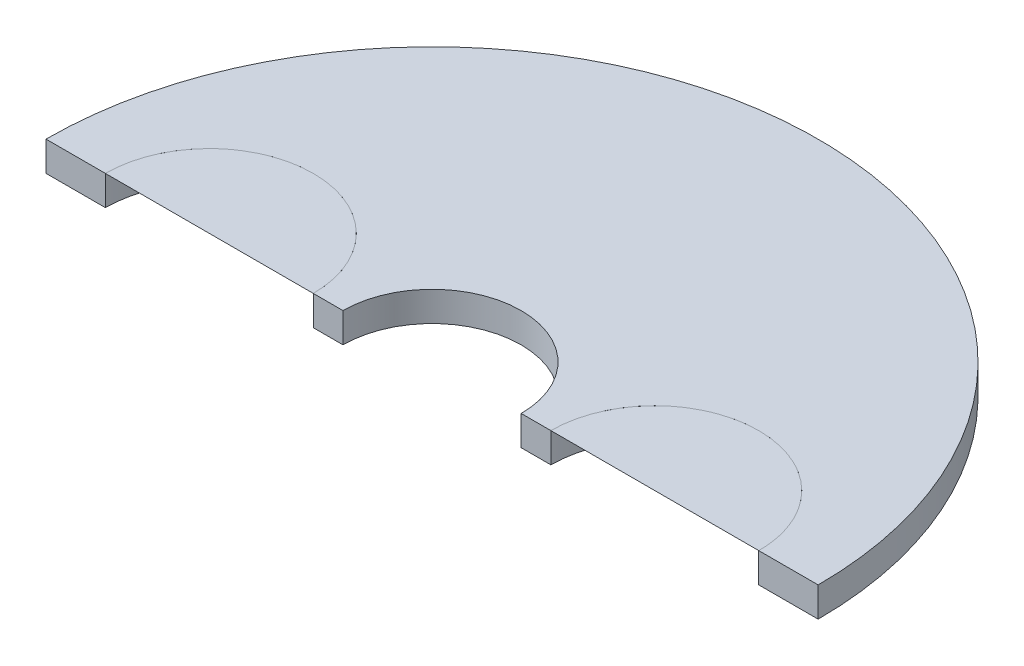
ISO-10303-21;
HEADER;
FILE_DESCRIPTION(('STEP AP214'),'2;1');
FILE_NAME('part.step','',(''),(''),'','','');
FILE_SCHEMA(('AUTOMOTIVE_DESIGN { 1 0 10303 214 1 1 1 1 }'));
ENDSEC;
DATA;
#1=APPLICATION_CONTEXT('core data for automotive mechanical design processes');
#2=APPLICATION_PROTOCOL_DEFINITION('international standard','automotive_design',2000,#1);
#3=PRODUCT_CONTEXT('',#1,'mechanical');
#4=PRODUCT('Part','Part','',(#3));
#5=PRODUCT_RELATED_PRODUCT_CATEGORY('part','',(#4));
#6=PRODUCT_DEFINITION_FORMATION('','',#4);
#7=PRODUCT_DEFINITION_CONTEXT('part definition',#1,'design');
#8=PRODUCT_DEFINITION('design','',#6,#7);
#9=PRODUCT_DEFINITION_SHAPE('','',#8);
#10=(LENGTH_UNIT() NAMED_UNIT(*) SI_UNIT(.MILLI.,.METRE.));
#11=(NAMED_UNIT(*) PLANE_ANGLE_UNIT() SI_UNIT($,.RADIAN.));
#12=(NAMED_UNIT(*) SI_UNIT($,.STERADIAN.) SOLID_ANGLE_UNIT());
#13=UNCERTAINTY_MEASURE_WITH_UNIT(LENGTH_MEASURE(1.E-05),#10,'distance_accuracy_value','');
#14=(GEOMETRIC_REPRESENTATION_CONTEXT(3) GLOBAL_UNCERTAINTY_ASSIGNED_CONTEXT((#13)) GLOBAL_UNIT_ASSIGNED_CONTEXT((#10,
#11,#12)) REPRESENTATION_CONTEXT('',''));
#15=CARTESIAN_POINT('',(0.,0.,0.));
#16=DIRECTION('',(0.,0.,1.));
#17=DIRECTION('',(1.,0.,0.));
#18=AXIS2_PLACEMENT_3D('',#15,#16,#17);
#19=CARTESIAN_POINT('',(4.,1.,0.));
#20=DIRECTION('',(0.,1.,0.));
#21=DIRECTION('',(1.,0.,0.));
#22=AXIS2_PLACEMENT_3D('',#19,#20,#21);
#23=PLANE('',#22);
#24=DIRECTION('',(1.,0.,0.));
#25=VECTOR('',#24,1.);
#26=CARTESIAN_POINT('',(7.5,1.,0.));
#27=LINE('',#26,#25);
#28=CARTESIAN_POINT('',(4.,1.,0.));
#29=VERTEX_POINT('',#28);
#30=CARTESIAN_POINT('',(11.,1.,0.));
#31=VERTEX_POINT('',#30);
#32=EDGE_CURVE('E12',#29,#31,#27,.T.);
#33=ORIENTED_EDGE('',*,*,#32,.T.);
#34=CARTESIAN_POINT('',(4.,1.,0.));
#35=CARTESIAN_POINT('',(4.,1.,-0.291666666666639));
#36=CARTESIAN_POINT('',(4.03546666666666,1.,-0.621599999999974));
#37=CARTESIAN_POINT('',(4.24453333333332,1.,-1.33839999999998));
#38=CARTESIAN_POINT('',(4.41999999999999,1.,-1.72666666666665));
#39=CARTESIAN_POINT('',(4.83999999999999,1.,-2.28666666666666));
#40=CARTESIAN_POINT('',(5.00597360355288,1.,-2.46884969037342));
#41=CARTESIAN_POINT('',(5.39128667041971,1.,-2.80512291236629));
#42=CARTESIAN_POINT('',(5.61072664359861,1.,-2.95905420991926));
#43=CARTESIAN_POINT('',(6.09515570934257,1.,-3.21741637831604));
#44=CARTESIAN_POINT('',(6.36011834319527,1.,-3.32161735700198));
#45=CARTESIAN_POINT('',(6.91680473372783,1.,-3.46299802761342));
#46=CARTESIAN_POINT('',(7.20833333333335,1.,-3.5));
#47=CARTESIAN_POINT('',(7.7916666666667,1.,-3.5));
#48=CARTESIAN_POINT('',(8.08319526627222,1.,-3.46299802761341));
#49=CARTESIAN_POINT('',(8.63988165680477,1.,-3.32161735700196));
#50=CARTESIAN_POINT('',(8.90484429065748,1.,-3.21741637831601));
#51=CARTESIAN_POINT('',(9.38927335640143,1.,-2.95905420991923));
#52=CARTESIAN_POINT('',(9.60871332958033,1.,-2.80512291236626));
#53=CARTESIAN_POINT('',(9.99402639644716,1.,-2.46884969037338));
#54=CARTESIAN_POINT('',(10.16,1.,-2.28666666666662));
#55=CARTESIAN_POINT('',(10.58,1.,-1.72666666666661));
#56=CARTESIAN_POINT('',(10.7554666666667,1.,-1.33839999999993));
#57=CARTESIAN_POINT('',(10.9645333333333,1.,-0.621599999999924));
#58=CARTESIAN_POINT('',(11.,1.,-0.291666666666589));
#59=CARTESIAN_POINT('',(11.,1.,0.));
#60=B_SPLINE_CURVE_WITH_KNOTS('',3,(#34,#35,#36,#37,#38,#39,#40,#41,#42,#43,#44,#45,#46,#47,#48,
#49,#50,#51,#52,#53,#54,#55,#56,#57,#58,#59),.UNSPECIFIED.,.F.,.F.,(4,2,2,2,2,2,2,2,2,2,2,2,4),
(0.,0.125,0.25,0.3125,0.375,0.4375,0.5,0.5625,0.625,0.6875,0.75,0.875,1.),.UNSPECIFIED.);
#61=EDGE_CURVE('E49',#31,#29,#60,.F.);
#62=ORIENTED_EDGE('',*,*,#61,.T.);
#63=EDGE_LOOP('',(#33,#62));
#64=FACE_BOUND('',#63,.T.);
#65=ADVANCED_FACE('F44',(#64),#23,.T.);
#66=OPEN_SHELL('',(#65));
#67=SHELL_BASED_SURFACE_MODEL('B2',(#66));
#68=CARTESIAN_POINT('',(-11.,1.,0.));
#69=DIRECTION('',(0.,1.,0.));
#70=DIRECTION('',(1.,0.,0.));
#71=AXIS2_PLACEMENT_3D('',#68,#69,#70);
#72=PLANE('',#71);
#73=DIRECTION('',(1.,0.,0.));
#74=VECTOR('',#73,1.);
#75=CARTESIAN_POINT('',(-7.5,1.,0.));
#76=LINE('',#75,#74);
#77=CARTESIAN_POINT('',(-11.,1.,0.));
#78=VERTEX_POINT('',#77);
#79=CARTESIAN_POINT('',(-4.,1.,0.));
#80=VERTEX_POINT('',#79);
#81=EDGE_CURVE('E42',#78,#80,#76,.T.);
#82=ORIENTED_EDGE('',*,*,#81,.T.);
#83=CARTESIAN_POINT('',(-11.,1.,0.));
#84=CARTESIAN_POINT('',(-11.,1.,-0.291666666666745));
#85=CARTESIAN_POINT('',(-10.9645333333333,1.,-0.621600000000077));
#86=CARTESIAN_POINT('',(-10.7554666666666,1.,-1.33840000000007));
#87=CARTESIAN_POINT('',(-10.58,1.,-1.72666666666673));
#88=CARTESIAN_POINT('',(-10.16,1.,-2.28666666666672));
#89=CARTESIAN_POINT('',(-9.99402639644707,1.,-2.46884969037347));
#90=CARTESIAN_POINT('',(-9.60871332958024,1.,-2.80512291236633));
#91=CARTESIAN_POINT('',(-9.38927335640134,1.,-2.95905420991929));
#92=CARTESIAN_POINT('',(-8.9048442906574,1.,-3.21741637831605));
#93=CARTESIAN_POINT('',(-8.63988165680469,1.,-3.32161735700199));
#94=CARTESIAN_POINT('',(-8.08319526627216,1.,-3.46299802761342));
#95=CARTESIAN_POINT('',(-7.79166666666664,1.,-3.5));
#96=CARTESIAN_POINT('',(-7.20833333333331,1.,-3.5));
#97=CARTESIAN_POINT('',(-6.9168047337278,1.,-3.46299802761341));
#98=CARTESIAN_POINT('',(-6.36011834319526,1.,-3.32161735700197));
#99=CARTESIAN_POINT('',(-6.09515570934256,1.,-3.21741637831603));
#100=CARTESIAN_POINT('',(-5.61072664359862,1.,-2.95905420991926));
#101=CARTESIAN_POINT('',(-5.39128667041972,1.,-2.8051229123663));
#102=CARTESIAN_POINT('',(-5.00597360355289,1.,-2.46884969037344));
#103=CARTESIAN_POINT('',(-4.84000000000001,1.,-2.28666666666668));
#104=CARTESIAN_POINT('',(-4.42000000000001,1.,-1.72666666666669));
#105=CARTESIAN_POINT('',(-4.24453333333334,1.,-1.33840000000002));
#106=CARTESIAN_POINT('',(-4.03546666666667,1.,-0.621600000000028));
#107=CARTESIAN_POINT('',(-4.,1.,-0.291666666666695));
#108=CARTESIAN_POINT('',(-4.,1.,0.));
#109=B_SPLINE_CURVE_WITH_KNOTS('',3,(#83,#84,#85,#86,#87,#88,#89,#90,#91,#92,#93,#94,#95,#96,
#97,#98,#99,#100,#101,#102,#103,#104,#105,#106,#107,#108),.UNSPECIFIED.,.F.,.F.,(4,2,2,2,2,2,2,
2,2,2,2,2,4),(0.,0.125,0.25,0.3125,0.375,0.4375,0.5,0.5625,0.625,0.6875,0.75,0.875,1.),.UNSPECIFIED.);
#110=EDGE_CURVE('E89',#80,#78,#109,.F.);
#111=ORIENTED_EDGE('',*,*,#110,.T.);
#112=EDGE_LOOP('',(#82,#111));
#113=FACE_BOUND('',#112,.T.);
#114=ADVANCED_FACE('F84',(#113),#72,.T.);
#115=OPEN_SHELL('',(#114));
#116=SHELL_BASED_SURFACE_MODEL('B6',(#115));
#117=CARTESIAN_POINT('',(0.,1.,0.));
#118=DIRECTION('',(0.,1.,0.));
#119=DIRECTION('',(0.,0.,1.));
#120=AXIS2_PLACEMENT_3D('',#117,#118,#119);
#121=PLANE('',#120);
#122=DIRECTION('',(1.,0.,0.));
#123=VECTOR('',#122,1.);
#124=CARTESIAN_POINT('',(0.,1.,0.));
#125=LINE('',#124,#123);
#126=CARTESIAN_POINT('',(11.,1.,0.));
#127=VERTEX_POINT('',#126);
#128=CARTESIAN_POINT('',(13.,1.,0.));
#129=VERTEX_POINT('',#128);
#130=EDGE_CURVE('E138',#127,#129,#125,.T.);
#131=ORIENTED_EDGE('',*,*,#130,.T.);
#132=CARTESIAN_POINT('',(0.,1.,0.));
#133=DIRECTION('',(0.,1.,0.));
#134=DIRECTION('',(0.,0.,1.));
#135=AXIS2_PLACEMENT_3D('',#132,#133,#134);
#136=CIRCLE('',#135,13.);
#137=CARTESIAN_POINT('',(-13.,1.,0.));
#138=VERTEX_POINT('',#137);
#139=EDGE_CURVE('E195',#129,#138,#136,.T.);
#140=ORIENTED_EDGE('',*,*,#139,.T.);
#141=CARTESIAN_POINT('',(-11.,1.,0.));
#142=VERTEX_POINT('',#141);
#143=EDGE_CURVE('E211',#138,#142,#125,.T.);
#144=ORIENTED_EDGE('',*,*,#143,.T.);
#145=CARTESIAN_POINT('',(-7.5,1.,0.));
#146=DIRECTION('',(0.,1.,0.));
#147=DIRECTION('',(0.,0.,1.));
#148=AXIS2_PLACEMENT_3D('',#145,#146,#147);
#149=CIRCLE('',#148,3.5);
#150=CARTESIAN_POINT('',(-4.,1.,0.));
#151=VERTEX_POINT('',#150);
#152=EDGE_CURVE('E218',#151,#142,#149,.T.);
#153=ORIENTED_EDGE('',*,*,#152,.F.);
#154=CARTESIAN_POINT('',(-3.,1.,0.));
#155=VERTEX_POINT('',#154);
#156=EDGE_CURVE('E220',#151,#155,#125,.T.);
#157=ORIENTED_EDGE('',*,*,#156,.T.);
#158=CARTESIAN_POINT('',(0.,1.,0.));
#159=DIRECTION('',(0.,1.,0.));
#160=DIRECTION('',(0.,0.,1.));
#161=AXIS2_PLACEMENT_3D('',#158,#159,#160);
#162=CIRCLE('',#161,3.);
#163=CARTESIAN_POINT('',(3.,1.,0.));
#164=VERTEX_POINT('',#163);
#165=EDGE_CURVE('E200',#164,#155,#162,.T.);
#166=ORIENTED_EDGE('',*,*,#165,.F.);
#167=CARTESIAN_POINT('',(4.,1.,0.));
#168=VERTEX_POINT('',#167);
#169=EDGE_CURVE('E249',#164,#168,#125,.T.);
#170=ORIENTED_EDGE('',*,*,#169,.T.);
#171=CARTESIAN_POINT('',(7.5,1.,0.));
#172=DIRECTION('',(0.,1.,0.));
#173=DIRECTION('',(0.,0.,1.));
#174=AXIS2_PLACEMENT_3D('',#171,#172,#173);
#175=CIRCLE('',#174,3.5);
#176=EDGE_CURVE('E227',#127,#168,#175,.T.);
#177=ORIENTED_EDGE('',*,*,#176,.F.);
#178=EDGE_LOOP('',(#131,#140,#144,#153,#157,#166,#170,#177));
#179=FACE_BOUND('',#178,.T.);
#180=ADVANCED_FACE('F115',(#179),#121,.T.);
#181=CARTESIAN_POINT('',(0.,0.,0.));
#182=DIRECTION('',(0.,1.,0.));
#183=DIRECTION('',(0.,0.,1.));
#184=AXIS2_PLACEMENT_3D('',#181,#182,#183);
#185=PLANE('',#184);
#186=CARTESIAN_POINT('',(0.,0.,0.));
#187=DIRECTION('',(0.,1.,0.));
#188=DIRECTION('',(0.,0.,1.));
#189=AXIS2_PLACEMENT_3D('',#186,#187,#188);
#190=CIRCLE('',#189,13.);
#191=CARTESIAN_POINT('',(13.,0.,0.));
#192=VERTEX_POINT('',#191);
#193=CARTESIAN_POINT('',(-13.,0.,0.));
#194=VERTEX_POINT('',#193);
#195=EDGE_CURVE('E193',#192,#194,#190,.T.);
#196=ORIENTED_EDGE('',*,*,#195,.F.);
#197=DIRECTION('',(-1.,0.,0.));
#198=VECTOR('',#197,1.);
#199=CARTESIAN_POINT('',(0.,0.,0.));
#200=LINE('',#199,#198);
#201=CARTESIAN_POINT('',(11.,0.,0.));
#202=VERTEX_POINT('',#201);
#203=EDGE_CURVE('E177',#192,#202,#200,.T.);
#204=ORIENTED_EDGE('',*,*,#203,.T.);
#205=CARTESIAN_POINT('',(7.5,0.,0.));
#206=DIRECTION('',(0.,1.,0.));
#207=DIRECTION('',(0.,0.,1.));
#208=AXIS2_PLACEMENT_3D('',#205,#206,#207);
#209=CIRCLE('',#208,3.5);
#210=CARTESIAN_POINT('',(4.,0.,0.));
#211=VERTEX_POINT('',#210);
#212=EDGE_CURVE('E224',#202,#211,#209,.T.);
#213=ORIENTED_EDGE('',*,*,#212,.T.);
#214=CARTESIAN_POINT('',(3.,0.,0.));
#215=VERTEX_POINT('',#214);
#216=EDGE_CURVE('E130',#211,#215,#200,.T.);
#217=ORIENTED_EDGE('',*,*,#216,.T.);
#218=CARTESIAN_POINT('',(0.,0.,0.));
#219=DIRECTION('',(0.,1.,0.));
#220=DIRECTION('',(0.,0.,1.));
#221=AXIS2_PLACEMENT_3D('',#218,#219,#220);
#222=CIRCLE('',#221,3.);
#223=CARTESIAN_POINT('',(-3.,0.,0.));
#224=VERTEX_POINT('',#223);
#225=EDGE_CURVE('E204',#215,#224,#222,.T.);
#226=ORIENTED_EDGE('',*,*,#225,.T.);
#227=CARTESIAN_POINT('',(-4.,0.,0.));
#228=VERTEX_POINT('',#227);
#229=EDGE_CURVE('E237',#224,#228,#200,.T.);
#230=ORIENTED_EDGE('',*,*,#229,.T.);
#231=CARTESIAN_POINT('',(-7.5,0.,0.));
#232=DIRECTION('',(0.,1.,0.));
#233=DIRECTION('',(0.,0.,1.));
#234=AXIS2_PLACEMENT_3D('',#231,#232,#233);
#235=CIRCLE('',#234,3.5);
#236=CARTESIAN_POINT('',(-11.,0.,0.));
#237=VERTEX_POINT('',#236);
#238=EDGE_CURVE('E225',#228,#237,#235,.T.);
#239=ORIENTED_EDGE('',*,*,#238,.T.);
#240=EDGE_CURVE('E188',#237,#194,#200,.T.);
#241=ORIENTED_EDGE('',*,*,#240,.T.);
#242=EDGE_LOOP('',(#196,#204,#213,#217,#226,#230,#239,#241));
#243=FACE_BOUND('',#242,.T.);
#244=ADVANCED_FACE('F198',(#243),#185,.F.);
#245=CARTESIAN_POINT('',(0.,1.,0.));
#246=DIRECTION('',(0.,-1.,0.));
#247=DIRECTION('',(0.,0.,-1.));
#248=AXIS2_PLACEMENT_3D('',#245,#246,#247);
#249=CYLINDRICAL_SURFACE('',#248,13.);
#250=ORIENTED_EDGE('',*,*,#139,.F.);
#251=DIRECTION('',(0.,1.,0.));
#252=VECTOR('',#251,1.);
#253=CARTESIAN_POINT('',(13.,1.,0.));
#254=LINE('',#253,#252);
#255=EDGE_CURVE('E180',#192,#129,#254,.T.);
#256=ORIENTED_EDGE('',*,*,#255,.F.);
#257=ORIENTED_EDGE('',*,*,#195,.T.);
#258=DIRECTION('',(0.,1.,0.));
#259=VECTOR('',#258,1.);
#260=CARTESIAN_POINT('',(-13.,1.,0.));
#261=LINE('',#260,#259);
#262=EDGE_CURVE('E186',#194,#138,#261,.T.);
#263=ORIENTED_EDGE('',*,*,#262,.T.);
#264=EDGE_LOOP('',(#250,#256,#257,#263));
#265=FACE_BOUND('',#264,.T.);
#266=ADVANCED_FACE('F117',(#265),#249,.T.);
#267=CARTESIAN_POINT('',(0.,1.,0.));
#268=DIRECTION('',(0.,-1.,0.));
#269=DIRECTION('',(0.,0.,-1.));
#270=AXIS2_PLACEMENT_3D('',#267,#268,#269);
#271=CYLINDRICAL_SURFACE('',#270,3.);
#272=DIRECTION('',(0.,-1.,0.));
#273=VECTOR('',#272,1.);
#274=CARTESIAN_POINT('',(3.,1.,0.));
#275=LINE('',#274,#273);
#276=EDGE_CURVE('E229',#164,#215,#275,.T.);
#277=ORIENTED_EDGE('',*,*,#276,.F.);
#278=ORIENTED_EDGE('',*,*,#165,.T.);
#279=DIRECTION('',(0.,-1.,0.));
#280=VECTOR('',#279,1.);
#281=CARTESIAN_POINT('',(-3.,1.,0.));
#282=LINE('',#281,#280);
#283=EDGE_CURVE('E243',#224,#155,#282,.F.);
#284=ORIENTED_EDGE('',*,*,#283,.F.);
#285=ORIENTED_EDGE('',*,*,#225,.F.);
#286=EDGE_LOOP('',(#277,#278,#284,#285));
#287=FACE_BOUND('',#286,.T.);
#288=ADVANCED_FACE('F241',(#287),#271,.F.);
#289=CARTESIAN_POINT('',(7.5,1.,0.));
#290=DIRECTION('',(0.,-1.,0.));
#291=DIRECTION('',(0.,0.,-1.));
#292=AXIS2_PLACEMENT_3D('',#289,#290,#291);
#293=CYLINDRICAL_SURFACE('',#292,3.5);
#294=DIRECTION('',(0.,-1.,0.));
#295=VECTOR('',#294,1.);
#296=CARTESIAN_POINT('',(11.,1.,0.));
#297=LINE('',#296,#295);
#298=EDGE_CURVE('E181',#127,#202,#297,.T.);
#299=ORIENTED_EDGE('',*,*,#298,.F.);
#300=ORIENTED_EDGE('',*,*,#176,.T.);
#301=DIRECTION('',(0.,-1.,0.));
#302=VECTOR('',#301,1.);
#303=CARTESIAN_POINT('',(4.,1.,0.));
#304=LINE('',#303,#302);
#305=EDGE_CURVE('E219',#211,#168,#304,.F.);
#306=ORIENTED_EDGE('',*,*,#305,.F.);
#307=ORIENTED_EDGE('',*,*,#212,.F.);
#308=EDGE_LOOP('',(#299,#300,#306,#307));
#309=FACE_BOUND('',#308,.T.);
#310=ADVANCED_FACE('F270',(#309),#293,.F.);
#311=CARTESIAN_POINT('',(-7.5,1.,0.));
#312=DIRECTION('',(0.,-1.,0.));
#313=DIRECTION('',(0.,0.,-1.));
#314=AXIS2_PLACEMENT_3D('',#311,#312,#313);
#315=CYLINDRICAL_SURFACE('',#314,3.5);
#316=DIRECTION('',(0.,-1.,0.));
#317=VECTOR('',#316,1.);
#318=CARTESIAN_POINT('',(-4.,1.,0.));
#319=LINE('',#318,#317);
#320=EDGE_CURVE('E82',#151,#228,#319,.T.);
#321=ORIENTED_EDGE('',*,*,#320,.F.);
#322=ORIENTED_EDGE('',*,*,#152,.T.);
#323=DIRECTION('',(0.,-1.,0.));
#324=VECTOR('',#323,1.);
#325=CARTESIAN_POINT('',(-11.,1.,0.));
#326=LINE('',#325,#324);
#327=EDGE_CURVE('E123',#237,#142,#326,.F.);
#328=ORIENTED_EDGE('',*,*,#327,.F.);
#329=ORIENTED_EDGE('',*,*,#238,.F.);
#330=EDGE_LOOP('',(#321,#322,#328,#329));
#331=FACE_BOUND('',#330,.T.);
#332=ADVANCED_FACE('F223',(#331),#315,.F.);
#333=CARTESIAN_POINT('',(0.,0.,0.));
#334=DIRECTION('',(0.,0.,-1.));
#335=DIRECTION('',(-1.,0.,0.));
#336=AXIS2_PLACEMENT_3D('',#333,#334,#335);
#337=PLANE('',#336);
#338=ORIENTED_EDGE('',*,*,#327,.T.);
#339=ORIENTED_EDGE('',*,*,#143,.F.);
#340=ORIENTED_EDGE('',*,*,#262,.F.);
#341=ORIENTED_EDGE('',*,*,#240,.F.);
#342=EDGE_LOOP('',(#338,#339,#340,#341));
#343=FACE_BOUND('',#342,.T.);
#344=ADVANCED_FACE('F210',(#343),#337,.F.);
#345=ORIENTED_EDGE('',*,*,#283,.T.);
#346=ORIENTED_EDGE('',*,*,#156,.F.);
#347=ORIENTED_EDGE('',*,*,#320,.T.);
#348=ORIENTED_EDGE('',*,*,#229,.F.);
#349=EDGE_LOOP('',(#345,#346,#347,#348));
#350=FACE_BOUND('',#349,.T.);
#351=ADVANCED_FACE('F252',(#350),#337,.F.);
#352=ORIENTED_EDGE('',*,*,#276,.T.);
#353=ORIENTED_EDGE('',*,*,#216,.F.);
#354=ORIENTED_EDGE('',*,*,#305,.T.);
#355=ORIENTED_EDGE('',*,*,#169,.F.);
#356=EDGE_LOOP('',(#352,#353,#354,#355));
#357=FACE_BOUND('',#356,.T.);
#358=ADVANCED_FACE('F254',(#357),#337,.F.);
#359=ORIENTED_EDGE('',*,*,#298,.T.);
#360=ORIENTED_EDGE('',*,*,#203,.F.);
#361=ORIENTED_EDGE('',*,*,#255,.T.);
#362=ORIENTED_EDGE('',*,*,#130,.F.);
#363=EDGE_LOOP('',(#359,#360,#361,#362));
#364=FACE_BOUND('',#363,.T.);
#365=ADVANCED_FACE('F179',(#364),#337,.F.);
#366=CLOSED_SHELL('',(#180,#244,#266,#288,#310,#332,#344,#351,#358,#365));
#367=MANIFOLD_SOLID_BREP('B36',#366);
#368=ADVANCED_BREP_SHAPE_REPRESENTATION('',(#18,#367),#14);
#369=MANIFOLD_SURFACE_SHAPE_REPRESENTATION('',(#18,#67,#116),#14);
#370=SHAPE_REPRESENTATION('',(#18),#14);
#371=SHAPE_DEFINITION_REPRESENTATION(#9,#370);
#372=SHAPE_REPRESENTATION_RELATIONSHIP('','',#370,#368);
#373=SHAPE_REPRESENTATION_RELATIONSHIP('','',#370,#369);
ENDSEC;
END-ISO-10303-21;
